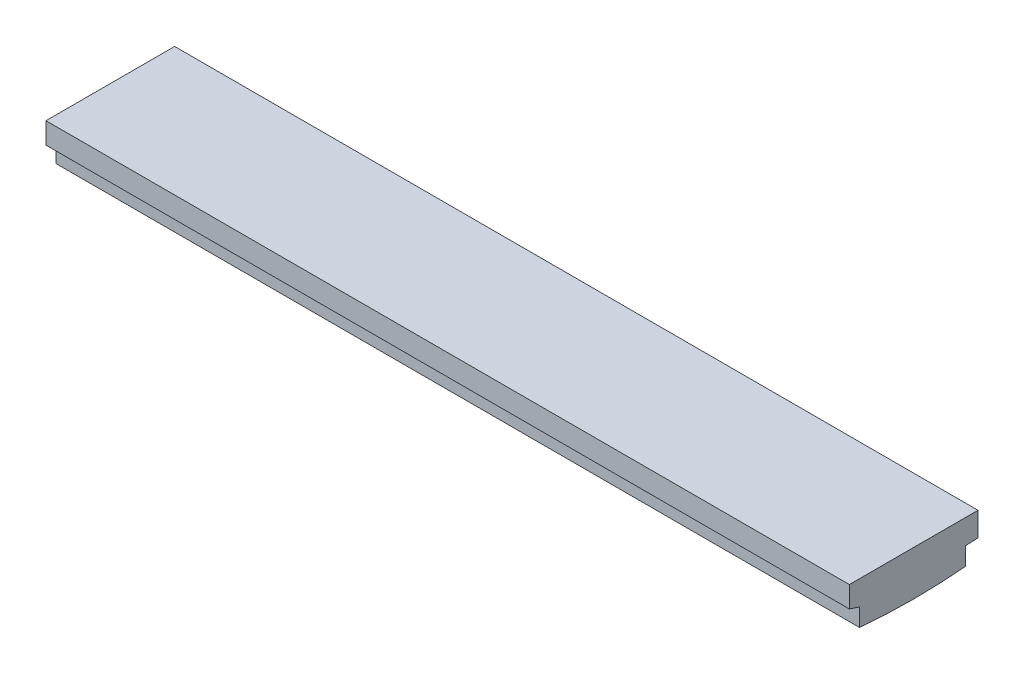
ISO-10303-21;
HEADER;
FILE_DESCRIPTION(('STEP AP214'),'2;1');
FILE_NAME('part.step','',(''),(''),'','','');
FILE_SCHEMA(('AUTOMOTIVE_DESIGN { 1 0 10303 214 1 1 1 1 }'));
ENDSEC;
DATA;
#1=APPLICATION_CONTEXT('core data for automotive mechanical design processes');
#2=APPLICATION_PROTOCOL_DEFINITION('international standard','automotive_design',2000,#1);
#3=PRODUCT_CONTEXT('',#1,'mechanical');
#4=PRODUCT('Part','Part','',(#3));
#5=PRODUCT_RELATED_PRODUCT_CATEGORY('part','',(#4));
#6=PRODUCT_DEFINITION_FORMATION('','',#4);
#7=PRODUCT_DEFINITION_CONTEXT('part definition',#1,'design');
#8=PRODUCT_DEFINITION('design','',#6,#7);
#9=PRODUCT_DEFINITION_SHAPE('','',#8);
#10=(LENGTH_UNIT() NAMED_UNIT(*) SI_UNIT(.MILLI.,.METRE.));
#11=(NAMED_UNIT(*) PLANE_ANGLE_UNIT() SI_UNIT($,.RADIAN.));
#12=(NAMED_UNIT(*) SI_UNIT($,.STERADIAN.) SOLID_ANGLE_UNIT());
#13=UNCERTAINTY_MEASURE_WITH_UNIT(LENGTH_MEASURE(1.E-05),#10,'distance_accuracy_value','');
#14=(GEOMETRIC_REPRESENTATION_CONTEXT(3) GLOBAL_UNCERTAINTY_ASSIGNED_CONTEXT((#13)) GLOBAL_UNIT_ASSIGNED_CONTEXT((#10,
#11,#12)) REPRESENTATION_CONTEXT('',''));
#15=CARTESIAN_POINT('',(0.,0.,0.));
#16=DIRECTION('',(0.,0.,1.));
#17=DIRECTION('',(1.,0.,0.));
#18=AXIS2_PLACEMENT_3D('',#15,#16,#17);
#19=CARTESIAN_POINT('',(45.5,2.025,6.));
#20=DIRECTION('',(0.,0.,-1.));
#21=DIRECTION('',(0.,1.,0.));
#22=AXIS2_PLACEMENT_3D('',#19,#20,#21);
#23=PLANE('',#22);
#24=DIRECTION('',(0.,-1.,0.));
#25=VECTOR('',#24,1.);
#26=CARTESIAN_POINT('',(45.5,2.025,6.));
#27=LINE('',#26,#25);
#28=CARTESIAN_POINT('',(45.5,0.,6.));
#29=VERTEX_POINT('',#28);
#30=CARTESIAN_POINT('',(45.5,-2.025,6.));
#31=VERTEX_POINT('',#30);
#32=EDGE_CURVE('E40',#29,#31,#27,.T.);
#33=ORIENTED_EDGE('',*,*,#32,.F.);
#34=DIRECTION('',(1.,0.,0.));
#35=VECTOR('',#34,1.);
#36=CARTESIAN_POINT('',(-45.5,0.,6.));
#37=LINE('',#36,#35);
#38=CARTESIAN_POINT('',(-45.5,0.,6.));
#39=VERTEX_POINT('',#38);
#40=EDGE_CURVE('E44',#39,#29,#37,.T.);
#41=ORIENTED_EDGE('',*,*,#40,.F.);
#42=DIRECTION('',(0.,-1.,0.));
#43=VECTOR('',#42,1.);
#44=CARTESIAN_POINT('',(-45.5,2.025,6.));
#45=LINE('',#44,#43);
#46=CARTESIAN_POINT('',(-45.5,-2.025,6.));
#47=VERTEX_POINT('',#46);
#48=EDGE_CURVE('E146',#39,#47,#45,.T.);
#49=ORIENTED_EDGE('',*,*,#48,.T.);
#50=DIRECTION('',(-1.,0.,0.));
#51=VECTOR('',#50,1.);
#52=CARTESIAN_POINT('',(45.5,-2.025,6.));
#53=LINE('',#52,#51);
#54=EDGE_CURVE('E11',#31,#47,#53,.T.);
#55=ORIENTED_EDGE('',*,*,#54,.F.);
#56=EDGE_LOOP('',(#33,#41,#49,#55));
#57=FACE_BOUND('',#56,.T.);
#58=ADVANCED_FACE('F26',(#57),#23,.F.);
#59=CARTESIAN_POINT('',(45.5,2.025,-6.));
#60=DIRECTION('',(0.,0.,1.));
#61=DIRECTION('',(0.,-1.,0.));
#62=AXIS2_PLACEMENT_3D('',#59,#60,#61);
#63=PLANE('',#62);
#64=DIRECTION('',(0.,1.,0.));
#65=VECTOR('',#64,1.);
#66=CARTESIAN_POINT('',(-45.5,2.025,-6.));
#67=LINE('',#66,#65);
#68=CARTESIAN_POINT('',(-45.5,-2.025,-6.));
#69=VERTEX_POINT('',#68);
#70=CARTESIAN_POINT('',(-45.5,0.,-6.));
#71=VERTEX_POINT('',#70);
#72=EDGE_CURVE('E148',#69,#71,#67,.T.);
#73=ORIENTED_EDGE('',*,*,#72,.T.);
#74=DIRECTION('',(1.,0.,0.));
#75=VECTOR('',#74,1.);
#76=CARTESIAN_POINT('',(-45.5,0.,-6.));
#77=LINE('',#76,#75);
#78=CARTESIAN_POINT('',(45.5,0.,-6.));
#79=VERTEX_POINT('',#78);
#80=EDGE_CURVE('E134',#71,#79,#77,.T.);
#81=ORIENTED_EDGE('',*,*,#80,.T.);
#82=DIRECTION('',(0.,1.,0.));
#83=VECTOR('',#82,1.);
#84=CARTESIAN_POINT('',(45.5,2.025,-6.));
#85=LINE('',#84,#83);
#86=CARTESIAN_POINT('',(45.5,-2.025,-6.));
#87=VERTEX_POINT('',#86);
#88=EDGE_CURVE('E152',#87,#79,#85,.T.);
#89=ORIENTED_EDGE('',*,*,#88,.F.);
#90=DIRECTION('',(-1.,0.,0.));
#91=VECTOR('',#90,1.);
#92=CARTESIAN_POINT('',(45.5,-2.025,-6.));
#93=LINE('',#92,#91);
#94=EDGE_CURVE('E33',#87,#69,#93,.T.);
#95=ORIENTED_EDGE('',*,*,#94,.T.);
#96=EDGE_LOOP('',(#73,#81,#89,#95));
#97=FACE_BOUND('',#96,.T.);
#98=ADVANCED_FACE('F157',(#97),#63,.F.);
#99=CARTESIAN_POINT('',(45.5,2.025,6.));
#100=DIRECTION('',(1.,0.,0.));
#101=DIRECTION('',(0.,0.,-1.));
#102=AXIS2_PLACEMENT_3D('',#99,#100,#101);
#103=PLANE('',#102);
#104=DIRECTION('',(0.,-0.309016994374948,-0.951056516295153));
#105=VECTOR('',#104,1.);
#106=CARTESIAN_POINT('',(45.5,0.376342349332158,7.15826265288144));
#107=LINE('',#106,#105);
#108=CARTESIAN_POINT('',(45.5,0.376342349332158,7.15826265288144));
#109=VERTEX_POINT('',#108);
#110=EDGE_CURVE('E115',#109,#29,#107,.T.);
#111=ORIENTED_EDGE('',*,*,#110,.T.);
#112=ORIENTED_EDGE('',*,*,#32,.T.);
#113=CARTESIAN_POINT('',(45.5,65.2078044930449,0.));
#114=DIRECTION('',(1.,0.,0.));
#115=DIRECTION('',(0.,0.,1.));
#116=AXIS2_PLACEMENT_3D('',#113,#114,#115);
#117=CIRCLE('',#116,67.5);
#118=EDGE_CURVE('E137',#31,#87,#117,.T.);
#119=ORIENTED_EDGE('',*,*,#118,.T.);
#120=ORIENTED_EDGE('',*,*,#88,.T.);
#121=DIRECTION('',(0.,0.0444884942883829,-0.999009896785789));
#122=VECTOR('',#121,1.);
#123=CARTESIAN_POINT('',(45.5,0.0628152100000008,-7.41054484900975));
#124=LINE('',#123,#122);
#125=CARTESIAN_POINT('',(45.5,0.0628152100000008,-7.41054484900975));
#126=VERTEX_POINT('',#125);
#127=EDGE_CURVE('E127',#79,#126,#124,.T.);
#128=ORIENTED_EDGE('',*,*,#127,.T.);
#129=DIRECTION('',(0.,1.,0.));
#130=VECTOR('',#129,1.);
#131=CARTESIAN_POINT('',(45.5,2.775,-7.41054484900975));
#132=LINE('',#131,#130);
#133=CARTESIAN_POINT('',(45.5,2.775,-7.41054484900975));
#134=VERTEX_POINT('',#133);
#135=EDGE_CURVE('E98',#126,#134,#132,.T.);
#136=ORIENTED_EDGE('',*,*,#135,.T.);
#137=DIRECTION('',(0.,0.,1.));
#138=VECTOR('',#137,1.);
#139=CARTESIAN_POINT('',(45.5,2.775,8.30826265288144));
#140=LINE('',#139,#138);
#141=CARTESIAN_POINT('',(45.5,2.775,7.15826265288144));
#142=VERTEX_POINT('',#141);
#143=EDGE_CURVE('E89',#134,#142,#140,.T.);
#144=ORIENTED_EDGE('',*,*,#143,.T.);
#145=DIRECTION('',(0.,-1.,0.));
#146=VECTOR('',#145,1.);
#147=CARTESIAN_POINT('',(45.5,2.775,7.15826265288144));
#148=LINE('',#147,#146);
#149=EDGE_CURVE('E94',#142,#109,#148,.T.);
#150=ORIENTED_EDGE('',*,*,#149,.T.);
#151=EDGE_LOOP('',(#111,#112,#119,#120,#128,#136,#144,#150));
#152=FACE_BOUND('',#151,.T.);
#153=ADVANCED_FACE('F92',(#152),#103,.T.);
#154=CARTESIAN_POINT('',(-45.5,2.025,6.));
#155=DIRECTION('',(1.,0.,0.));
#156=DIRECTION('',(0.,0.,-1.));
#157=AXIS2_PLACEMENT_3D('',#154,#155,#156);
#158=PLANE('',#157);
#159=ORIENTED_EDGE('',*,*,#48,.F.);
#160=DIRECTION('',(0.,-0.309016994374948,-0.951056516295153));
#161=VECTOR('',#160,1.);
#162=CARTESIAN_POINT('',(-45.5,0.376342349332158,7.15826265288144));
#163=LINE('',#162,#161);
#164=CARTESIAN_POINT('',(-45.5,0.376342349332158,7.15826265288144));
#165=VERTEX_POINT('',#164);
#166=EDGE_CURVE('E121',#165,#39,#163,.T.);
#167=ORIENTED_EDGE('',*,*,#166,.F.);
#168=DIRECTION('',(0.,-1.,0.));
#169=VECTOR('',#168,1.);
#170=CARTESIAN_POINT('',(-45.5,2.775,7.15826265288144));
#171=LINE('',#170,#169);
#172=CARTESIAN_POINT('',(-45.5,2.775,7.15826265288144));
#173=VERTEX_POINT('',#172);
#174=EDGE_CURVE('E117',#173,#165,#171,.T.);
#175=ORIENTED_EDGE('',*,*,#174,.F.);
#176=DIRECTION('',(0.,0.,1.));
#177=VECTOR('',#176,1.);
#178=CARTESIAN_POINT('',(-45.5,2.775,8.30826265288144));
#179=LINE('',#178,#177);
#180=CARTESIAN_POINT('',(-45.5,2.775,-7.41054484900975));
#181=VERTEX_POINT('',#180);
#182=EDGE_CURVE('E102',#181,#173,#179,.T.);
#183=ORIENTED_EDGE('',*,*,#182,.F.);
#184=DIRECTION('',(0.,1.,0.));
#185=VECTOR('',#184,1.);
#186=CARTESIAN_POINT('',(-45.5,2.775,-7.41054484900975));
#187=LINE('',#186,#185);
#188=CARTESIAN_POINT('',(-45.5,0.0628152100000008,-7.41054484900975));
#189=VERTEX_POINT('',#188);
#190=EDGE_CURVE('E129',#189,#181,#187,.T.);
#191=ORIENTED_EDGE('',*,*,#190,.F.);
#192=DIRECTION('',(0.,0.0444884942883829,-0.999009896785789));
#193=VECTOR('',#192,1.);
#194=CARTESIAN_POINT('',(-45.5,0.0628152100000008,-7.41054484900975));
#195=LINE('',#194,#193);
#196=EDGE_CURVE('E131',#71,#189,#195,.T.);
#197=ORIENTED_EDGE('',*,*,#196,.F.);
#198=ORIENTED_EDGE('',*,*,#72,.F.);
#199=CARTESIAN_POINT('',(-45.5,65.2078044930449,0.));
#200=DIRECTION('',(1.,0.,0.));
#201=DIRECTION('',(0.,0.,1.));
#202=AXIS2_PLACEMENT_3D('',#199,#200,#201);
#203=CIRCLE('',#202,67.5);
#204=EDGE_CURVE('E111',#47,#69,#203,.T.);
#205=ORIENTED_EDGE('',*,*,#204,.F.);
#206=EDGE_LOOP('',(#159,#167,#175,#183,#191,#197,#198,#205));
#207=FACE_BOUND('',#206,.T.);
#208=ADVANCED_FACE('F163',(#207),#158,.F.);
#209=CARTESIAN_POINT('',(45.5,2.775,8.30826265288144));
#210=DIRECTION('',(0.,-1.,0.));
#211=DIRECTION('',(0.,0.,-1.));
#212=AXIS2_PLACEMENT_3D('',#209,#210,#211);
#213=PLANE('',#212);
#214=ORIENTED_EDGE('',*,*,#182,.T.);
#215=DIRECTION('',(1.,0.,0.));
#216=VECTOR('',#215,1.);
#217=CARTESIAN_POINT('',(-45.5,2.775,7.15826265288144));
#218=LINE('',#217,#216);
#219=EDGE_CURVE('E105',#173,#142,#218,.T.);
#220=ORIENTED_EDGE('',*,*,#219,.T.);
#221=ORIENTED_EDGE('',*,*,#143,.F.);
#222=DIRECTION('',(-1.,0.,0.));
#223=VECTOR('',#222,1.);
#224=CARTESIAN_POINT('',(45.5,2.775,-7.41054484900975));
#225=LINE('',#224,#223);
#226=EDGE_CURVE('E101',#134,#181,#225,.T.);
#227=ORIENTED_EDGE('',*,*,#226,.T.);
#228=EDGE_LOOP('',(#214,#220,#221,#227));
#229=FACE_BOUND('',#228,.T.);
#230=ADVANCED_FACE('F106',(#229),#213,.F.);
#231=CARTESIAN_POINT('',(-45.5,65.2078044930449,0.));
#232=DIRECTION('',(1.,0.,0.));
#233=DIRECTION('',(0.,0.,-1.));
#234=AXIS2_PLACEMENT_3D('',#231,#232,#233);
#235=CYLINDRICAL_SURFACE('',#234,67.5);
#236=ORIENTED_EDGE('',*,*,#118,.F.);
#237=ORIENTED_EDGE('',*,*,#54,.T.);
#238=ORIENTED_EDGE('',*,*,#204,.T.);
#239=ORIENTED_EDGE('',*,*,#94,.F.);
#240=EDGE_LOOP('',(#236,#237,#238,#239));
#241=FACE_BOUND('',#240,.T.);
#242=ADVANCED_FACE('F161',(#241),#235,.T.);
#243=CARTESIAN_POINT('',(-45.5,2.775,-7.41054484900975));
#244=DIRECTION('',(0.,0.,-1.));
#245=DIRECTION('',(-1.,0.,0.));
#246=AXIS2_PLACEMENT_3D('',#243,#244,#245);
#247=PLANE('',#246);
#248=ORIENTED_EDGE('',*,*,#135,.F.);
#249=DIRECTION('',(1.,0.,0.));
#250=VECTOR('',#249,1.);
#251=CARTESIAN_POINT('',(-45.5,0.0628152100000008,-7.41054484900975));
#252=LINE('',#251,#250);
#253=EDGE_CURVE('E135',#189,#126,#252,.T.);
#254=ORIENTED_EDGE('',*,*,#253,.F.);
#255=ORIENTED_EDGE('',*,*,#190,.T.);
#256=ORIENTED_EDGE('',*,*,#226,.F.);
#257=EDGE_LOOP('',(#248,#254,#255,#256));
#258=FACE_BOUND('',#257,.T.);
#259=ADVANCED_FACE('F184',(#258),#247,.T.);
#260=CARTESIAN_POINT('',(-45.5,0.0628152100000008,-7.41054484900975));
#261=DIRECTION('',(0.,-0.999009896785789,-0.0444884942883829));
#262=DIRECTION('',(0.,0.0444884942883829,-0.999009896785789));
#263=AXIS2_PLACEMENT_3D('',#260,#261,#262);
#264=PLANE('',#263);
#265=ORIENTED_EDGE('',*,*,#127,.F.);
#266=ORIENTED_EDGE('',*,*,#80,.F.);
#267=ORIENTED_EDGE('',*,*,#196,.T.);
#268=ORIENTED_EDGE('',*,*,#253,.T.);
#269=EDGE_LOOP('',(#265,#266,#267,#268));
#270=FACE_BOUND('',#269,.T.);
#271=ADVANCED_FACE('F168',(#270),#264,.T.);
#272=CARTESIAN_POINT('',(-45.5,0.376342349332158,7.15826265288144));
#273=DIRECTION('',(0.,-0.951056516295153,0.309016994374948));
#274=DIRECTION('',(0.,-0.309016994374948,-0.951056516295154));
#275=AXIS2_PLACEMENT_3D('',#272,#273,#274);
#276=PLANE('',#275);
#277=ORIENTED_EDGE('',*,*,#110,.F.);
#278=DIRECTION('',(1.,0.,0.));
#279=VECTOR('',#278,1.);
#280=CARTESIAN_POINT('',(-45.5,0.376342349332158,7.15826265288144));
#281=LINE('',#280,#279);
#282=EDGE_CURVE('E114',#165,#109,#281,.T.);
#283=ORIENTED_EDGE('',*,*,#282,.F.);
#284=ORIENTED_EDGE('',*,*,#166,.T.);
#285=ORIENTED_EDGE('',*,*,#40,.T.);
#286=EDGE_LOOP('',(#277,#283,#284,#285));
#287=FACE_BOUND('',#286,.T.);
#288=ADVANCED_FACE('F190',(#287),#276,.T.);
#289=CARTESIAN_POINT('',(-45.5,2.775,7.15826265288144));
#290=DIRECTION('',(0.,0.,1.));
#291=DIRECTION('',(1.,0.,0.));
#292=AXIS2_PLACEMENT_3D('',#289,#290,#291);
#293=PLANE('',#292);
#294=ORIENTED_EDGE('',*,*,#149,.F.);
#295=ORIENTED_EDGE('',*,*,#219,.F.);
#296=ORIENTED_EDGE('',*,*,#174,.T.);
#297=ORIENTED_EDGE('',*,*,#282,.T.);
#298=EDGE_LOOP('',(#294,#295,#296,#297));
#299=FACE_BOUND('',#298,.T.);
#300=ADVANCED_FACE('F113',(#299),#293,.T.);
#301=CLOSED_SHELL('',(#58,#98,#153,#208,#230,#242,#259,#271,#288,#300));
#302=MANIFOLD_SOLID_BREP('B2',#301);
#303=ADVANCED_BREP_SHAPE_REPRESENTATION('',(#18,#302),#14);
#304=SHAPE_DEFINITION_REPRESENTATION(#9,#303);
ENDSEC;
END-ISO-10303-21;
